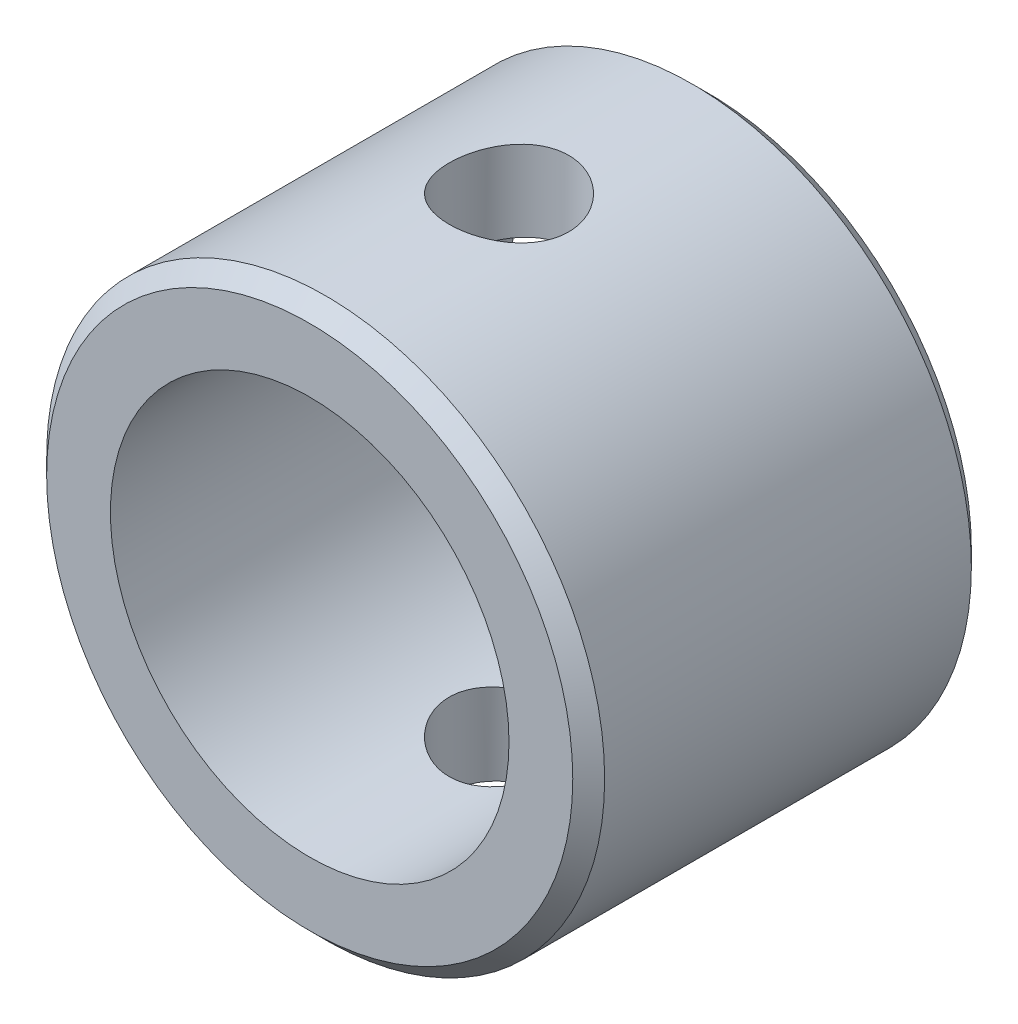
ISO-10303-21;
HEADER;
FILE_DESCRIPTION(('STEP AP214'),'2;1');
FILE_NAME('part.step','',(''),(''),'','','');
FILE_SCHEMA(('AUTOMOTIVE_DESIGN { 1 0 10303 214 1 1 1 1 }'));
ENDSEC;
DATA;
#1=APPLICATION_CONTEXT('core data for automotive mechanical design processes');
#2=APPLICATION_PROTOCOL_DEFINITION('international standard','automotive_design',2000,#1);
#3=PRODUCT_CONTEXT('',#1,'mechanical');
#4=PRODUCT('Part','Part','',(#3));
#5=PRODUCT_RELATED_PRODUCT_CATEGORY('part','',(#4));
#6=PRODUCT_DEFINITION_FORMATION('','',#4);
#7=PRODUCT_DEFINITION_CONTEXT('part definition',#1,'design');
#8=PRODUCT_DEFINITION('design','',#6,#7);
#9=PRODUCT_DEFINITION_SHAPE('','',#8);
#10=(LENGTH_UNIT() NAMED_UNIT(*) SI_UNIT(.MILLI.,.METRE.));
#11=(NAMED_UNIT(*) PLANE_ANGLE_UNIT() SI_UNIT($,.RADIAN.));
#12=(NAMED_UNIT(*) SI_UNIT($,.STERADIAN.) SOLID_ANGLE_UNIT());
#13=UNCERTAINTY_MEASURE_WITH_UNIT(LENGTH_MEASURE(1.E-05),#10,'distance_accuracy_value','');
#14=(GEOMETRIC_REPRESENTATION_CONTEXT(3) GLOBAL_UNCERTAINTY_ASSIGNED_CONTEXT((#13)) GLOBAL_UNIT_ASSIGNED_CONTEXT((#10,
#11,#12)) REPRESENTATION_CONTEXT('',''));
#15=CARTESIAN_POINT('',(0.,0.,0.));
#16=DIRECTION('',(0.,0.,1.));
#17=DIRECTION('',(1.,0.,0.));
#18=AXIS2_PLACEMENT_3D('',#15,#16,#17);
#19=CARTESIAN_POINT('',(0.,0.,2.5));
#20=DIRECTION('',(0.,0.,1.));
#21=DIRECTION('',(1.,0.,0.));
#22=AXIS2_PLACEMENT_3D('',#19,#20,#21);
#23=PLANE('',#22);
#24=CARTESIAN_POINT('',(0.,0.,2.5));
#25=DIRECTION('',(0.,0.,1.));
#26=DIRECTION('',(1.,0.,0.));
#27=AXIS2_PLACEMENT_3D('',#24,#25,#26);
#28=CIRCLE('',#27,3.3);
#29=CARTESIAN_POINT('',(3.3,0.,2.5));
#30=VERTEX_POINT('',#29);
#31=EDGE_CURVE('E10',#30,#30,#28,.T.);
#32=ORIENTED_EDGE('',*,*,#31,.T.);
#33=EDGE_LOOP('',(#32));
#34=FACE_BOUND('',#33,.T.);
#35=CARTESIAN_POINT('',(0.,0.,2.5));
#36=DIRECTION('',(0.,0.,1.));
#37=DIRECTION('',(1.,0.,0.));
#38=AXIS2_PLACEMENT_3D('',#35,#36,#37);
#39=CIRCLE('',#38,2.5);
#40=CARTESIAN_POINT('',(2.5,0.,2.5));
#41=VERTEX_POINT('',#40);
#42=EDGE_CURVE('E89',#41,#41,#39,.T.);
#43=ORIENTED_EDGE('',*,*,#42,.F.);
#44=EDGE_LOOP('',(#43));
#45=FACE_BOUND('',#44,.T.);
#46=ADVANCED_FACE('F32',(#34,#45),#23,.T.);
#47=CARTESIAN_POINT('',(0.,0.,-2.5));
#48=DIRECTION('',(0.,0.,1.));
#49=DIRECTION('',(1.,0.,0.));
#50=AXIS2_PLACEMENT_3D('',#47,#48,#49);
#51=PLANE('',#50);
#52=CARTESIAN_POINT('',(0.,0.,-2.5));
#53=DIRECTION('',(0.,0.,1.));
#54=DIRECTION('',(1.,0.,0.));
#55=AXIS2_PLACEMENT_3D('',#52,#53,#54);
#56=CIRCLE('',#55,3.3);
#57=CARTESIAN_POINT('',(3.3,0.,-2.5));
#58=VERTEX_POINT('',#57);
#59=EDGE_CURVE('E46',#58,#58,#56,.F.);
#60=ORIENTED_EDGE('',*,*,#59,.T.);
#61=EDGE_LOOP('',(#60));
#62=FACE_BOUND('',#61,.T.);
#63=CARTESIAN_POINT('',(0.,0.,-2.5));
#64=DIRECTION('',(0.,0.,1.));
#65=DIRECTION('',(1.,0.,0.));
#66=AXIS2_PLACEMENT_3D('',#63,#64,#65);
#67=CIRCLE('',#66,2.5);
#68=CARTESIAN_POINT('',(2.5,0.,-2.5));
#69=VERTEX_POINT('',#68);
#70=EDGE_CURVE('E86',#69,#69,#67,.T.);
#71=ORIENTED_EDGE('',*,*,#70,.T.);
#72=EDGE_LOOP('',(#71));
#73=FACE_BOUND('',#72,.T.);
#74=ADVANCED_FACE('F110',(#62,#73),#51,.F.);
#75=CARTESIAN_POINT('',(0.,0.,2.5));
#76=DIRECTION('',(0.,0.,-1.));
#77=DIRECTION('',(-1.,0.,0.));
#78=AXIS2_PLACEMENT_3D('',#75,#76,#77);
#79=CYLINDRICAL_SURFACE('',#78,3.5);
#80=CARTESIAN_POINT('',(0.,-3.5,0.75));
#81=CARTESIAN_POINT('',(0.0416179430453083,-3.49999923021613,0.749998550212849));
#82=CARTESIAN_POINT('',(0.0832535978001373,-3.49925012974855,0.746524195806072));
#83=CARTESIAN_POINT('',(0.165343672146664,-3.49633414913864,0.732732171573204));
#84=CARTESIAN_POINT('',(0.205797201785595,-3.4941662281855,0.722409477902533));
#85=CARTESIAN_POINT('',(0.284324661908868,-3.48865415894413,0.695257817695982));
#86=CARTESIAN_POINT('',(0.322400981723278,-3.48531121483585,0.678435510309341));
#87=CARTESIAN_POINT('',(0.395189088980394,-3.47781053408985,0.638782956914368));
#88=CARTESIAN_POINT('',(0.429900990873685,-3.4736528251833,0.615952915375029));
#89=CARTESIAN_POINT('',(0.495512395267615,-3.46490684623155,0.564559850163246));
#90=CARTESIAN_POINT('',(0.526352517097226,-3.4603134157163,0.535921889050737));
#91=CARTESIAN_POINT('',(0.582830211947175,-3.45125034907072,0.473886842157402));
#92=CARTESIAN_POINT('',(0.608467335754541,-3.44678072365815,0.440489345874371));
#93=CARTESIAN_POINT('',(0.654071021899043,-3.43842058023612,0.369447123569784));
#94=CARTESIAN_POINT('',(0.673974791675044,-3.4345366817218,0.331761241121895));
#95=CARTESIAN_POINT('',(0.707144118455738,-3.42786162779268,0.253482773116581));
#96=CARTESIAN_POINT('',(0.720410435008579,-3.42507034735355,0.212890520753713));
#97=CARTESIAN_POINT('',(0.739732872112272,-3.42094904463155,0.130594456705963));
#98=CARTESIAN_POINT('',(0.745893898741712,-3.41959778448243,0.0889163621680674));
#99=CARTESIAN_POINT('',(0.751156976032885,-3.41844569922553,0.00509788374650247));
#100=CARTESIAN_POINT('',(0.750259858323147,-3.41864469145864,-0.0370424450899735));
#101=CARTESIAN_POINT('',(0.741516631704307,-3.42055138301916,-0.119812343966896));
#102=CARTESIAN_POINT('',(0.733791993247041,-3.42223270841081,-0.160455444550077));
#103=CARTESIAN_POINT('',(0.711805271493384,-3.42687296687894,-0.239855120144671));
#104=CARTESIAN_POINT('',(0.697542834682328,-3.42983196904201,-0.27861159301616));
#105=CARTESIAN_POINT('',(0.662772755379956,-3.43672040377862,-0.353481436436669));
#106=CARTESIAN_POINT('',(0.642218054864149,-3.44065710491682,-0.389572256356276));
#107=CARTESIAN_POINT('',(0.595480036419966,-3.44905286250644,-0.457837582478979));
#108=CARTESIAN_POINT('',(0.56929598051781,-3.45351198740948,-0.490011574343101));
#109=CARTESIAN_POINT('',(0.511397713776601,-3.46256359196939,-0.550229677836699));
#110=CARTESIAN_POINT('',(0.479580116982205,-3.46715691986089,-0.578174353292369));
#111=CARTESIAN_POINT('',(0.411658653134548,-3.4758750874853,-0.62834686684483));
#112=CARTESIAN_POINT('',(0.3755547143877,-3.47999991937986,-0.650574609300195));
#113=CARTESIAN_POINT('',(0.29996673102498,-3.48732889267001,-0.688705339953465));
#114=CARTESIAN_POINT('',(0.260476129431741,-3.49053119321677,-0.704595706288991));
#115=CARTESIAN_POINT('',(0.179301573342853,-3.49564054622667,-0.729487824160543));
#116=CARTESIAN_POINT('',(0.137617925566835,-3.49754777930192,-0.738490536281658));
#117=CARTESIAN_POINT('',(0.0540938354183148,-3.49982653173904,-0.749208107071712));
#118=CARTESIAN_POINT('',(0.0122715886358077,-3.50022668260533,-0.75105885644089));
#119=CARTESIAN_POINT('',(-0.071084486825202,-3.49952624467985,-0.747787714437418));
#120=CARTESIAN_POINT('',(-0.112618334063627,-3.49842575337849,-0.74266627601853));
#121=CARTESIAN_POINT('',(-0.193771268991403,-3.49486571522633,-0.725708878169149));
#122=CARTESIAN_POINT('',(-0.233405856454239,-3.4924205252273,-0.713943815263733));
#123=CARTESIAN_POINT('',(-0.310139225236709,-3.48644462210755,-0.68411152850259));
#124=CARTESIAN_POINT('',(-0.34723779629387,-3.48291381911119,-0.666043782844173));
#125=CARTESIAN_POINT('',(-0.418410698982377,-3.475087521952,-0.623833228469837));
#126=CARTESIAN_POINT('',(-0.45243628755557,-3.47078215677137,-0.599610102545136));
#127=CARTESIAN_POINT('',(-0.515988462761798,-3.46190516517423,-0.545882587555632));
#128=CARTESIAN_POINT('',(-0.545514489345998,-3.45733350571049,-0.516377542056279));
#129=CARTESIAN_POINT('',(-0.599763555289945,-3.44834086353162,-0.452301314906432));
#130=CARTESIAN_POINT('',(-0.624392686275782,-3.44392396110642,-0.417649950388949));
#131=CARTESIAN_POINT('',(-0.667482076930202,-3.4358332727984,-0.344622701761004));
#132=CARTESIAN_POINT('',(-0.685942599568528,-3.43215945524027,-0.306246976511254));
#133=CARTESIAN_POINT('',(-0.716048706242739,-3.42600504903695,-0.227063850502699));
#134=CARTESIAN_POINT('',(-0.727731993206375,-3.42351787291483,-0.186271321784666));
#135=CARTESIAN_POINT('',(-0.744063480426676,-3.42000593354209,-0.103242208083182));
#136=CARTESIAN_POINT('',(-0.748712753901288,-3.41898094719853,-0.0610058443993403));
#137=CARTESIAN_POINT('',(-0.750799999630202,-3.41852309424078,0.0227661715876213));
#138=CARTESIAN_POINT('',(-0.748386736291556,-3.41905738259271,0.0642980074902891));
#139=CARTESIAN_POINT('',(-0.736748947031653,-3.42158381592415,0.146348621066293));
#140=CARTESIAN_POINT('',(-0.727524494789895,-3.42357594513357,0.186867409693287));
#141=CARTESIAN_POINT('',(-0.702596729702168,-3.42877790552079,0.265629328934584));
#142=CARTESIAN_POINT('',(-0.686914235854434,-3.43198382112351,0.303879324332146));
#143=CARTESIAN_POINT('',(-0.649533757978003,-3.43925382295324,0.377227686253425));
#144=CARTESIAN_POINT('',(-0.627835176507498,-3.44331799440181,0.412325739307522));
#145=CARTESIAN_POINT('',(-0.578541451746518,-3.45194527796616,0.479109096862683));
#146=CARTESIAN_POINT('',(-0.550839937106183,-3.45651654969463,0.510714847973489));
#147=CARTESIAN_POINT('',(-0.49054327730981,-3.46558724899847,0.56887813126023));
#148=CARTESIAN_POINT('',(-0.457947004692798,-3.47008665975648,0.595434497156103));
#149=CARTESIAN_POINT('',(-0.388301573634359,-3.47857245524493,0.643057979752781));
#150=CARTESIAN_POINT('',(-0.351202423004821,-3.48255182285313,0.664053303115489));
#151=CARTESIAN_POINT('',(-0.273925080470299,-3.48947913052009,0.699477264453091));
#152=CARTESIAN_POINT('',(-0.23374955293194,-3.49242795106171,0.713911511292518));
#153=CARTESIAN_POINT('',(-0.161267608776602,-3.49642424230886,0.733176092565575));
#154=CARTESIAN_POINT('',(-0.129358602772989,-3.49775695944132,0.739473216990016));
#155=CARTESIAN_POINT('',(-0.0649699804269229,-3.4995451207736,0.747885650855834));
#156=CARTESIAN_POINT('',(-0.0324903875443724,-3.50000060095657,0.75000113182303));
#157=CARTESIAN_POINT('',(0.,-3.5,0.75));
#158=B_SPLINE_CURVE_WITH_KNOTS('',3,(#80,#81,#82,#83,#84,#85,#86,#87,#88,#89,#90,#91,#92,#93,
#94,#95,#96,#97,#98,#99,#100,#101,#102,#103,#104,#105,#106,#107,#108,#109,#110,#111,#112,#113,
#114,#115,#116,#117,#118,#119,#120,#121,#122,#123,#124,#125,#126,#127,#128,#129,#130,#131,#132,
#133,#134,#135,#136,#137,#138,#139,#140,#141,#142,#143,#144,#145,#146,#147,#148,#149,#150,#151,
#152,#153,#154,#155,#156,#157),.UNSPECIFIED.,.T.,.F.,(4,2,2,2,2,2,2,2,2,2,2,2,2,2,2,2,2,2,2,2,2,
2,2,2,2,2,2,2,2,2,2,2,2,2,2,2,2,2,4),(0.,0.124734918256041,0.249561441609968,0.374260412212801,
0.498955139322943,0.62537480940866,0.751805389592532,0.879572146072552,1.00732427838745,
1.13316504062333,1.25899097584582,1.38262237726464,1.50626046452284,1.63084678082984,
1.75544943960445,1.88263505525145,2.00982279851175,2.13726260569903,2.26468463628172,
2.38967332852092,2.51465390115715,2.63832530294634,2.76200694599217,2.88739366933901,
3.01279598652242,3.14041031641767,3.26801920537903,3.39491120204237,3.52178383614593,
3.64600340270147,3.77022162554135,3.89404249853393,4.01787567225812,4.14411475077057,
4.27038295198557,4.39820955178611,4.52592667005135,4.62330899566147,4.72068732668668),.UNSPECIFIED.);
#159=CARTESIAN_POINT('',(0.,-3.5,0.75));
#160=VERTEX_POINT('',#159);
#161=EDGE_CURVE('E80',#160,#160,#158,.T.);
#162=ORIENTED_EDGE('',*,*,#161,.T.);
#163=EDGE_LOOP('',(#162));
#164=FACE_BOUND('',#163,.T.);
#165=CARTESIAN_POINT('',(0.,3.5,0.75));
#166=CARTESIAN_POINT('',(-0.0416179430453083,3.49999923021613,0.749998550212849));
#167=CARTESIAN_POINT('',(-0.0832535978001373,3.49925012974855,0.746524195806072));
#168=CARTESIAN_POINT('',(-0.165343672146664,3.49633414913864,0.732732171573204));
#169=CARTESIAN_POINT('',(-0.205797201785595,3.4941662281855,0.722409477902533));
#170=CARTESIAN_POINT('',(-0.284324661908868,3.48865415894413,0.695257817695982));
#171=CARTESIAN_POINT('',(-0.322400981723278,3.48531121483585,0.678435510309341));
#172=CARTESIAN_POINT('',(-0.395189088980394,3.47781053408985,0.638782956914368));
#173=CARTESIAN_POINT('',(-0.429900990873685,3.4736528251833,0.615952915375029));
#174=CARTESIAN_POINT('',(-0.495512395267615,3.46490684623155,0.564559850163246));
#175=CARTESIAN_POINT('',(-0.526352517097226,3.4603134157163,0.535921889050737));
#176=CARTESIAN_POINT('',(-0.582830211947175,3.45125034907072,0.473886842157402));
#177=CARTESIAN_POINT('',(-0.608467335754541,3.44678072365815,0.440489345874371));
#178=CARTESIAN_POINT('',(-0.654071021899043,3.43842058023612,0.369447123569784));
#179=CARTESIAN_POINT('',(-0.673974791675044,3.4345366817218,0.331761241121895));
#180=CARTESIAN_POINT('',(-0.707144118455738,3.42786162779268,0.253482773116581));
#181=CARTESIAN_POINT('',(-0.720410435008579,3.42507034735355,0.212890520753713));
#182=CARTESIAN_POINT('',(-0.739732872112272,3.42094904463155,0.130594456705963));
#183=CARTESIAN_POINT('',(-0.745893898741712,3.41959778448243,0.0889163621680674));
#184=CARTESIAN_POINT('',(-0.751156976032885,3.41844569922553,0.00509788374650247));
#185=CARTESIAN_POINT('',(-0.750259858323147,3.41864469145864,-0.0370424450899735));
#186=CARTESIAN_POINT('',(-0.741516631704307,3.42055138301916,-0.119812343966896));
#187=CARTESIAN_POINT('',(-0.733791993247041,3.42223270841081,-0.160455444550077));
#188=CARTESIAN_POINT('',(-0.711805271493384,3.42687296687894,-0.239855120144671));
#189=CARTESIAN_POINT('',(-0.697542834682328,3.42983196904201,-0.27861159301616));
#190=CARTESIAN_POINT('',(-0.662772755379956,3.43672040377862,-0.353481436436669));
#191=CARTESIAN_POINT('',(-0.642218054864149,3.44065710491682,-0.389572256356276));
#192=CARTESIAN_POINT('',(-0.595480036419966,3.44905286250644,-0.457837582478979));
#193=CARTESIAN_POINT('',(-0.56929598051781,3.45351198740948,-0.490011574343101));
#194=CARTESIAN_POINT('',(-0.511397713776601,3.46256359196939,-0.550229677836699));
#195=CARTESIAN_POINT('',(-0.479580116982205,3.46715691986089,-0.578174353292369));
#196=CARTESIAN_POINT('',(-0.411658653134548,3.4758750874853,-0.62834686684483));
#197=CARTESIAN_POINT('',(-0.3755547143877,3.47999991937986,-0.650574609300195));
#198=CARTESIAN_POINT('',(-0.29996673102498,3.48732889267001,-0.688705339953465));
#199=CARTESIAN_POINT('',(-0.260476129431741,3.49053119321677,-0.704595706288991));
#200=CARTESIAN_POINT('',(-0.179301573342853,3.49564054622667,-0.729487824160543));
#201=CARTESIAN_POINT('',(-0.137617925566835,3.49754777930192,-0.738490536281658));
#202=CARTESIAN_POINT('',(-0.0540938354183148,3.49982653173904,-0.749208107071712));
#203=CARTESIAN_POINT('',(-0.0122715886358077,3.50022668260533,-0.75105885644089));
#204=CARTESIAN_POINT('',(0.071084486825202,3.49952624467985,-0.747787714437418));
#205=CARTESIAN_POINT('',(0.112618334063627,3.49842575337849,-0.74266627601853));
#206=CARTESIAN_POINT('',(0.193771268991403,3.49486571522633,-0.725708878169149));
#207=CARTESIAN_POINT('',(0.233405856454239,3.4924205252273,-0.713943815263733));
#208=CARTESIAN_POINT('',(0.310139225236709,3.48644462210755,-0.68411152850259));
#209=CARTESIAN_POINT('',(0.34723779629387,3.48291381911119,-0.666043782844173));
#210=CARTESIAN_POINT('',(0.418410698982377,3.475087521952,-0.623833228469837));
#211=CARTESIAN_POINT('',(0.45243628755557,3.47078215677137,-0.599610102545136));
#212=CARTESIAN_POINT('',(0.515988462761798,3.46190516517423,-0.545882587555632));
#213=CARTESIAN_POINT('',(0.545514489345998,3.45733350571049,-0.516377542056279));
#214=CARTESIAN_POINT('',(0.599763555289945,3.44834086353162,-0.452301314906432));
#215=CARTESIAN_POINT('',(0.624392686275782,3.44392396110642,-0.417649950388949));
#216=CARTESIAN_POINT('',(0.667482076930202,3.4358332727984,-0.344622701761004));
#217=CARTESIAN_POINT('',(0.685942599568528,3.43215945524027,-0.306246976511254));
#218=CARTESIAN_POINT('',(0.716048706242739,3.42600504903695,-0.227063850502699));
#219=CARTESIAN_POINT('',(0.727731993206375,3.42351787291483,-0.186271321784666));
#220=CARTESIAN_POINT('',(0.744063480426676,3.42000593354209,-0.103242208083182));
#221=CARTESIAN_POINT('',(0.748712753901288,3.41898094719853,-0.0610058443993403));
#222=CARTESIAN_POINT('',(0.750799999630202,3.41852309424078,0.0227661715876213));
#223=CARTESIAN_POINT('',(0.748386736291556,3.41905738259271,0.0642980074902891));
#224=CARTESIAN_POINT('',(0.736748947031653,3.42158381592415,0.146348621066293));
#225=CARTESIAN_POINT('',(0.727524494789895,3.42357594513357,0.186867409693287));
#226=CARTESIAN_POINT('',(0.702596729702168,3.42877790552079,0.265629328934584));
#227=CARTESIAN_POINT('',(0.686914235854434,3.43198382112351,0.303879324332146));
#228=CARTESIAN_POINT('',(0.649533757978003,3.43925382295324,0.377227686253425));
#229=CARTESIAN_POINT('',(0.627835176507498,3.44331799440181,0.412325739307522));
#230=CARTESIAN_POINT('',(0.578541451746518,3.45194527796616,0.479109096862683));
#231=CARTESIAN_POINT('',(0.550839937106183,3.45651654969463,0.510714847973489));
#232=CARTESIAN_POINT('',(0.49054327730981,3.46558724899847,0.56887813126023));
#233=CARTESIAN_POINT('',(0.457947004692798,3.47008665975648,0.595434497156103));
#234=CARTESIAN_POINT('',(0.388301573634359,3.47857245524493,0.643057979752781));
#235=CARTESIAN_POINT('',(0.351202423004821,3.48255182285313,0.664053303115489));
#236=CARTESIAN_POINT('',(0.273925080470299,3.48947913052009,0.699477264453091));
#237=CARTESIAN_POINT('',(0.23374955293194,3.49242795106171,0.713911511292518));
#238=CARTESIAN_POINT('',(0.161267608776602,3.49642424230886,0.733176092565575));
#239=CARTESIAN_POINT('',(0.129358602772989,3.49775695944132,0.739473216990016));
#240=CARTESIAN_POINT('',(0.0649699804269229,3.4995451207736,0.747885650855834));
#241=CARTESIAN_POINT('',(0.0324903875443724,3.50000060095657,0.75000113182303));
#242=CARTESIAN_POINT('',(0.,3.5,0.75));
#243=B_SPLINE_CURVE_WITH_KNOTS('',3,(#165,#166,#167,#168,#169,#170,#171,#172,#173,#174,#175,
#176,#177,#178,#179,#180,#181,#182,#183,#184,#185,#186,#187,#188,#189,#190,#191,#192,#193,#194,
#195,#196,#197,#198,#199,#200,#201,#202,#203,#204,#205,#206,#207,#208,#209,#210,#211,#212,#213,
#214,#215,#216,#217,#218,#219,#220,#221,#222,#223,#224,#225,#226,#227,#228,#229,#230,#231,#232,
#233,#234,#235,#236,#237,#238,#239,#240,#241,#242),.UNSPECIFIED.,.T.,.F.,(4,2,2,2,2,2,2,2,2,2,2,
2,2,2,2,2,2,2,2,2,2,2,2,2,2,2,2,2,2,2,2,2,2,2,2,2,2,2,4),(0.,0.124734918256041,
0.249561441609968,0.374260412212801,0.498955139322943,0.62537480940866,0.751805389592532,
0.879572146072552,1.00732427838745,1.13316504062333,1.25899097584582,1.38262237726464,
1.50626046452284,1.63084678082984,1.75544943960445,1.88263505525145,2.00982279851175,
2.13726260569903,2.26468463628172,2.38967332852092,2.51465390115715,2.63832530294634,
2.76200694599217,2.88739366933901,3.01279598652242,3.14041031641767,3.26801920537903,
3.39491120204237,3.52178383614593,3.64600340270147,3.77022162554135,3.89404249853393,
4.01787567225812,4.14411475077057,4.27038295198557,4.39820955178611,4.52592667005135,
4.62330899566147,4.72068732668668),.UNSPECIFIED.);
#244=CARTESIAN_POINT('',(0.,3.5,0.75));
#245=VERTEX_POINT('',#244);
#246=EDGE_CURVE('E75',#245,#245,#243,.T.);
#247=ORIENTED_EDGE('',*,*,#246,.T.);
#248=EDGE_LOOP('',(#247));
#249=FACE_BOUND('',#248,.T.);
#250=CARTESIAN_POINT('',(0.,0.,-2.3));
#251=DIRECTION('',(0.,0.,1.));
#252=DIRECTION('',(1.,0.,0.));
#253=AXIS2_PLACEMENT_3D('',#250,#251,#252);
#254=CIRCLE('',#253,3.5);
#255=CARTESIAN_POINT('',(3.5,0.,-2.3));
#256=VERTEX_POINT('',#255);
#257=EDGE_CURVE('E51',#256,#256,#254,.T.);
#258=ORIENTED_EDGE('',*,*,#257,.T.);
#259=EDGE_LOOP('',(#258));
#260=FACE_BOUND('',#259,.T.);
#261=CARTESIAN_POINT('',(0.,0.,2.3));
#262=DIRECTION('',(0.,0.,1.));
#263=DIRECTION('',(1.,0.,0.));
#264=AXIS2_PLACEMENT_3D('',#261,#262,#263);
#265=CIRCLE('',#264,3.5);
#266=CARTESIAN_POINT('',(3.5,0.,2.3));
#267=VERTEX_POINT('',#266);
#268=EDGE_CURVE('E92',#267,#267,#265,.F.);
#269=ORIENTED_EDGE('',*,*,#268,.T.);
#270=EDGE_LOOP('',(#269));
#271=FACE_BOUND('',#270,.T.);
#272=ADVANCED_FACE('F34',(#164,#249,#260,#271),#79,.T.);
#273=CARTESIAN_POINT('',(0.,0.,2.5));
#274=DIRECTION('',(0.,0.,-1.));
#275=DIRECTION('',(-1.,0.,0.));
#276=AXIS2_PLACEMENT_3D('',#273,#274,#275);
#277=CYLINDRICAL_SURFACE('',#276,2.5);
#278=CARTESIAN_POINT('',(0.,-2.5,0.75));
#279=CARTESIAN_POINT('',(0.04114430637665,-2.49999964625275,0.749999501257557));
#280=CARTESIAN_POINT('',(0.0822936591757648,-2.49897457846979,0.746603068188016));
#281=CARTESIAN_POINT('',(0.16339406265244,-2.49498552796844,0.73313932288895));
#282=CARTESIAN_POINT('',(0.20334475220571,-2.49202096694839,0.723070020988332));
#283=CARTESIAN_POINT('',(0.280866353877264,-2.48447776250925,0.696626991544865));
#284=CARTESIAN_POINT('',(0.318440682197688,-2.47990150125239,0.680262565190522));
#285=CARTESIAN_POINT('',(0.390312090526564,-2.46961054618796,0.641731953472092));
#286=CARTESIAN_POINT('',(0.42460873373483,-2.46389570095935,0.619564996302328));
#287=CARTESIAN_POINT('',(0.489935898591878,-2.45175368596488,0.569387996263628));
#288=CARTESIAN_POINT('',(0.52085903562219,-2.445311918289,0.541241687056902));
#289=CARTESIAN_POINT('',(0.577624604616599,-2.43252917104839,0.480195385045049));
#290=CARTESIAN_POINT('',(0.603466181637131,-2.42618820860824,0.447294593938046));
#291=CARTESIAN_POINT('',(0.649900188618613,-2.41417056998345,0.376764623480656));
#292=CARTESIAN_POINT('',(0.67036154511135,-2.4085120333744,0.339045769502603));
#293=CARTESIAN_POINT('',(0.704606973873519,-2.39871810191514,0.260505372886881));
#294=CARTESIAN_POINT('',(0.71839264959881,-2.39458234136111,0.219684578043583));
#295=CARTESIAN_POINT('',(0.738508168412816,-2.38845435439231,0.13730486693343));
#296=CARTESIAN_POINT('',(0.745035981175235,-2.38640534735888,0.0957986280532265));
#297=CARTESIAN_POINT('',(0.751068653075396,-2.38451394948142,0.0122334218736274));
#298=CARTESIAN_POINT('',(0.750575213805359,-2.38467102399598,-0.0298254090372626));
#299=CARTESIAN_POINT('',(0.742734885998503,-2.38712372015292,-0.111691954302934));
#300=CARTESIAN_POINT('',(0.735636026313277,-2.38934194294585,-0.151526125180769));
#301=CARTESIAN_POINT('',(0.715187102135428,-2.39554178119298,-0.229409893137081));
#302=CARTESIAN_POINT('',(0.701836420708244,-2.3995235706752,-0.267459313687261));
#303=CARTESIAN_POINT('',(0.669080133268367,-2.40886366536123,-0.341300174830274));
#304=CARTESIAN_POINT('',(0.649594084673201,-2.4142400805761,-0.377053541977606));
#305=CARTESIAN_POINT('',(0.605176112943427,-2.42575493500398,-0.444866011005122));
#306=CARTESIAN_POINT('',(0.580242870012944,-2.43189355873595,-0.476924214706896));
#307=CARTESIAN_POINT('',(0.524406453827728,-2.44455505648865,-0.537843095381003));
#308=CARTESIAN_POINT('',(0.493297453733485,-2.45108327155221,-0.566514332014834));
#309=CARTESIAN_POINT('',(0.426631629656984,-2.46356122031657,-0.618276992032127));
#310=CARTESIAN_POINT('',(0.391074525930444,-2.46951091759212,-0.641368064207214));
#311=CARTESIAN_POINT('',(0.316177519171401,-2.48021580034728,-0.681429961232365));
#312=CARTESIAN_POINT('',(0.276813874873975,-2.48496271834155,-0.698358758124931));
#313=CARTESIAN_POINT('',(0.195622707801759,-2.49266760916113,-0.725299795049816));
#314=CARTESIAN_POINT('',(0.153795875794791,-2.495626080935,-0.735313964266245));
#315=CARTESIAN_POINT('',(0.0704761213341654,-2.49934182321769,-0.747826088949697));
#316=CARTESIAN_POINT('',(0.0290250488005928,-2.50017425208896,-0.750580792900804));
#317=CARTESIAN_POINT('',(-0.0537498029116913,-2.49976461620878,-0.749215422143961));
#318=CARTESIAN_POINT('',(-0.0950735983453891,-2.49852282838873,-0.745096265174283));
#319=CARTESIAN_POINT('',(-0.17545180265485,-2.49415348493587,-0.730307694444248));
#320=CARTESIAN_POINT('',(-0.21453638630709,-2.49106914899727,-0.719788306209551));
#321=CARTESIAN_POINT('',(-0.290377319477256,-2.48337173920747,-0.692678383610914));
#322=CARTESIAN_POINT('',(-0.327133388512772,-2.47875848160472,-0.676087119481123));
#323=CARTESIAN_POINT('',(-0.398218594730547,-2.46834827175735,-0.636873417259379));
#324=CARTESIAN_POINT('',(-0.432471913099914,-2.4625264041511,-0.614120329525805));
#325=CARTESIAN_POINT('',(-0.496761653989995,-2.45036734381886,-0.563387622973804));
#326=CARTESIAN_POINT('',(-0.526797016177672,-2.44403002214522,-0.535406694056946));
#327=CARTESIAN_POINT('',(-0.582928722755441,-2.43126585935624,-0.473806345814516));
#328=CARTESIAN_POINT('',(-0.608842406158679,-2.42484412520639,-0.440019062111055));
#329=CARTESIAN_POINT('',(-0.654644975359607,-2.41288257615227,-0.36843603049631));
#330=CARTESIAN_POINT('',(-0.674534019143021,-2.40734273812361,-0.330640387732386));
#331=CARTESIAN_POINT('',(-0.707586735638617,-2.39783594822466,-0.252233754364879));
#332=CARTESIAN_POINT('',(-0.720781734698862,-2.39386168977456,-0.211636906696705));
#333=CARTESIAN_POINT('',(-0.740108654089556,-2.38795797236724,-0.128656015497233));
#334=CARTESIAN_POINT('',(-0.746242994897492,-2.38602781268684,-0.0862725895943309));
#335=CARTESIAN_POINT('',(-0.751109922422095,-2.38449986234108,-0.00281924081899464));
#336=CARTESIAN_POINT('',(-0.750140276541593,-2.38480823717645,0.0382318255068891));
#337=CARTESIAN_POINT('',(-0.741537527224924,-2.38749700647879,0.119557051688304));
#338=CARTESIAN_POINT('',(-0.733904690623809,-2.3898773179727,0.159831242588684));
#339=CARTESIAN_POINT('',(-0.712384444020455,-2.39637881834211,0.237972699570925));
#340=CARTESIAN_POINT('',(-0.698575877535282,-2.40047802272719,0.275863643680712));
#341=CARTESIAN_POINT('',(-0.665157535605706,-2.40995139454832,0.348821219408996));
#342=CARTESIAN_POINT('',(-0.645546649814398,-2.41532580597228,0.383887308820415));
#343=CARTESIAN_POINT('',(-0.600243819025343,-2.42698838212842,0.451581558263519));
#344=CARTESIAN_POINT('',(-0.574356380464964,-2.43330270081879,0.484074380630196));
#345=CARTESIAN_POINT('',(-0.517587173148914,-2.44600660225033,0.544351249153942));
#346=CARTESIAN_POINT('',(-0.486704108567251,-2.45239620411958,0.572134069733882));
#347=CARTESIAN_POINT('',(-0.419732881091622,-2.46475468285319,0.623011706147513));
#348=CARTESIAN_POINT('',(-0.383518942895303,-2.47070579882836,0.645945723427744));
#349=CARTESIAN_POINT('',(-0.307570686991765,-2.48130340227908,0.685367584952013));
#350=CARTESIAN_POINT('',(-0.267838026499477,-2.48595049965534,0.701858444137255));
#351=CARTESIAN_POINT('',(-0.19037885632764,-2.4930108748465,0.726447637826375));
#352=CARTESIAN_POINT('',(-0.152893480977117,-2.49561013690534,0.735255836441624));
#353=CARTESIAN_POINT('',(-0.0769400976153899,-2.49910472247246,0.747031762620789));
#354=CARTESIAN_POINT('',(-0.0384722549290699,-2.5000003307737,0.75000046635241));
#355=CARTESIAN_POINT('',(0.,-2.5,0.75));
#356=B_SPLINE_CURVE_WITH_KNOTS('',3,(#278,#279,#280,#281,#282,#283,#284,#285,#286,#287,#288,
#289,#290,#291,#292,#293,#294,#295,#296,#297,#298,#299,#300,#301,#302,#303,#304,#305,#306,#307,
#308,#309,#310,#311,#312,#313,#314,#315,#316,#317,#318,#319,#320,#321,#322,#323,#324,#325,#326,
#327,#328,#329,#330,#331,#332,#333,#334,#335,#336,#337,#338,#339,#340,#341,#342,#343,#344,#345,
#346,#347,#348,#349,#350,#351,#352,#353,#354,#355),.UNSPECIFIED.,.T.,.F.,(4,2,2,2,2,2,2,2,2,2,2,
2,2,2,2,2,2,2,2,2,2,2,2,2,2,2,2,2,2,2,2,2,2,2,2,2,2,2,4),(0.,0.123291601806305,0.246619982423,
0.369766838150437,0.492930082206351,0.619278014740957,0.745647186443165,0.874857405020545,
1.00403657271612,1.12959844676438,1.25512989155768,1.37613008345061,1.49714221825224,
1.61981213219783,1.74251180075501,1.87033552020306,1.99816728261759,2.12685523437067,
2.25550726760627,2.37954404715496,2.50356426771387,2.62478373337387,2.74601777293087,
2.87005652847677,2.99412640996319,3.12270200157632,3.25127422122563,3.37923907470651,
3.50716004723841,3.62975077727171,3.75233659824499,3.8734002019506,3.99448698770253,
4.11998462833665,4.2455148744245,4.37471498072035,4.50385455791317,4.61915845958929,
4.73444308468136),.UNSPECIFIED.);
#357=CARTESIAN_POINT('',(0.,-2.5,0.75));
#358=VERTEX_POINT('',#357);
#359=EDGE_CURVE('E37',#358,#358,#356,.T.);
#360=ORIENTED_EDGE('',*,*,#359,.F.);
#361=EDGE_LOOP('',(#360));
#362=FACE_BOUND('',#361,.T.);
#363=CARTESIAN_POINT('',(0.,2.5,0.75));
#364=CARTESIAN_POINT('',(-0.04114430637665,2.49999964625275,0.749999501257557));
#365=CARTESIAN_POINT('',(-0.0822936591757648,2.49897457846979,0.746603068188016));
#366=CARTESIAN_POINT('',(-0.16339406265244,2.49498552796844,0.73313932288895));
#367=CARTESIAN_POINT('',(-0.20334475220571,2.49202096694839,0.723070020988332));
#368=CARTESIAN_POINT('',(-0.280866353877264,2.48447776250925,0.696626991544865));
#369=CARTESIAN_POINT('',(-0.318440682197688,2.47990150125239,0.680262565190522));
#370=CARTESIAN_POINT('',(-0.390312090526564,2.46961054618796,0.641731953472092));
#371=CARTESIAN_POINT('',(-0.42460873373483,2.46389570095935,0.619564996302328));
#372=CARTESIAN_POINT('',(-0.489935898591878,2.45175368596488,0.569387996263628));
#373=CARTESIAN_POINT('',(-0.52085903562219,2.445311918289,0.541241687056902));
#374=CARTESIAN_POINT('',(-0.577624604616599,2.43252917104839,0.480195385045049));
#375=CARTESIAN_POINT('',(-0.603466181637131,2.42618820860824,0.447294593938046));
#376=CARTESIAN_POINT('',(-0.649900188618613,2.41417056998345,0.376764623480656));
#377=CARTESIAN_POINT('',(-0.67036154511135,2.4085120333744,0.339045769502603));
#378=CARTESIAN_POINT('',(-0.704606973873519,2.39871810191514,0.260505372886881));
#379=CARTESIAN_POINT('',(-0.71839264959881,2.39458234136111,0.219684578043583));
#380=CARTESIAN_POINT('',(-0.738508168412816,2.38845435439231,0.13730486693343));
#381=CARTESIAN_POINT('',(-0.745035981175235,2.38640534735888,0.0957986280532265));
#382=CARTESIAN_POINT('',(-0.751068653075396,2.38451394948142,0.0122334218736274));
#383=CARTESIAN_POINT('',(-0.750575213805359,2.38467102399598,-0.0298254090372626));
#384=CARTESIAN_POINT('',(-0.742734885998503,2.38712372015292,-0.111691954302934));
#385=CARTESIAN_POINT('',(-0.735636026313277,2.38934194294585,-0.151526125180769));
#386=CARTESIAN_POINT('',(-0.715187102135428,2.39554178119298,-0.229409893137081));
#387=CARTESIAN_POINT('',(-0.701836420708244,2.3995235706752,-0.267459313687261));
#388=CARTESIAN_POINT('',(-0.669080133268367,2.40886366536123,-0.341300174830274));
#389=CARTESIAN_POINT('',(-0.649594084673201,2.4142400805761,-0.377053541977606));
#390=CARTESIAN_POINT('',(-0.605176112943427,2.42575493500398,-0.444866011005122));
#391=CARTESIAN_POINT('',(-0.580242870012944,2.43189355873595,-0.476924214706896));
#392=CARTESIAN_POINT('',(-0.524406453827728,2.44455505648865,-0.537843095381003));
#393=CARTESIAN_POINT('',(-0.493297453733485,2.45108327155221,-0.566514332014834));
#394=CARTESIAN_POINT('',(-0.426631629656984,2.46356122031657,-0.618276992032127));
#395=CARTESIAN_POINT('',(-0.391074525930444,2.46951091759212,-0.641368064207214));
#396=CARTESIAN_POINT('',(-0.316177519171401,2.48021580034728,-0.681429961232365));
#397=CARTESIAN_POINT('',(-0.276813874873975,2.48496271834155,-0.698358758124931));
#398=CARTESIAN_POINT('',(-0.195622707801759,2.49266760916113,-0.725299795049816));
#399=CARTESIAN_POINT('',(-0.153795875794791,2.495626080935,-0.735313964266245));
#400=CARTESIAN_POINT('',(-0.0704761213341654,2.49934182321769,-0.747826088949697));
#401=CARTESIAN_POINT('',(-0.0290250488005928,2.50017425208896,-0.750580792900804));
#402=CARTESIAN_POINT('',(0.0537498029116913,2.49976461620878,-0.749215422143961));
#403=CARTESIAN_POINT('',(0.0950735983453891,2.49852282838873,-0.745096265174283));
#404=CARTESIAN_POINT('',(0.17545180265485,2.49415348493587,-0.730307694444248));
#405=CARTESIAN_POINT('',(0.21453638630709,2.49106914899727,-0.719788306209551));
#406=CARTESIAN_POINT('',(0.290377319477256,2.48337173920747,-0.692678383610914));
#407=CARTESIAN_POINT('',(0.327133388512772,2.47875848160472,-0.676087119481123));
#408=CARTESIAN_POINT('',(0.398218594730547,2.46834827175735,-0.636873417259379));
#409=CARTESIAN_POINT('',(0.432471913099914,2.4625264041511,-0.614120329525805));
#410=CARTESIAN_POINT('',(0.496761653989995,2.45036734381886,-0.563387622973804));
#411=CARTESIAN_POINT('',(0.526797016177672,2.44403002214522,-0.535406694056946));
#412=CARTESIAN_POINT('',(0.582928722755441,2.43126585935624,-0.473806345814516));
#413=CARTESIAN_POINT('',(0.608842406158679,2.42484412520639,-0.440019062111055));
#414=CARTESIAN_POINT('',(0.654644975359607,2.41288257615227,-0.36843603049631));
#415=CARTESIAN_POINT('',(0.674534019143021,2.40734273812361,-0.330640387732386));
#416=CARTESIAN_POINT('',(0.707586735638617,2.39783594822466,-0.252233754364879));
#417=CARTESIAN_POINT('',(0.720781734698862,2.39386168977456,-0.211636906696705));
#418=CARTESIAN_POINT('',(0.740108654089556,2.38795797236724,-0.128656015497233));
#419=CARTESIAN_POINT('',(0.746242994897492,2.38602781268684,-0.0862725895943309));
#420=CARTESIAN_POINT('',(0.751109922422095,2.38449986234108,-0.00281924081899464));
#421=CARTESIAN_POINT('',(0.750140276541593,2.38480823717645,0.0382318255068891));
#422=CARTESIAN_POINT('',(0.741537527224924,2.38749700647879,0.119557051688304));
#423=CARTESIAN_POINT('',(0.733904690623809,2.3898773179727,0.159831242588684));
#424=CARTESIAN_POINT('',(0.712384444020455,2.39637881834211,0.237972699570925));
#425=CARTESIAN_POINT('',(0.698575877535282,2.40047802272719,0.275863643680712));
#426=CARTESIAN_POINT('',(0.665157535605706,2.40995139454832,0.348821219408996));
#427=CARTESIAN_POINT('',(0.645546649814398,2.41532580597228,0.383887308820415));
#428=CARTESIAN_POINT('',(0.600243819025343,2.42698838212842,0.451581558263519));
#429=CARTESIAN_POINT('',(0.574356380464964,2.43330270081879,0.484074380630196));
#430=CARTESIAN_POINT('',(0.517587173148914,2.44600660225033,0.544351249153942));
#431=CARTESIAN_POINT('',(0.486704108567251,2.45239620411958,0.572134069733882));
#432=CARTESIAN_POINT('',(0.419732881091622,2.46475468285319,0.623011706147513));
#433=CARTESIAN_POINT('',(0.383518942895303,2.47070579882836,0.645945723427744));
#434=CARTESIAN_POINT('',(0.307570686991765,2.48130340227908,0.685367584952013));
#435=CARTESIAN_POINT('',(0.267838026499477,2.48595049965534,0.701858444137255));
#436=CARTESIAN_POINT('',(0.19037885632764,2.4930108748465,0.726447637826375));
#437=CARTESIAN_POINT('',(0.152893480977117,2.49561013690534,0.735255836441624));
#438=CARTESIAN_POINT('',(0.0769400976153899,2.49910472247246,0.747031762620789));
#439=CARTESIAN_POINT('',(0.0384722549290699,2.5000003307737,0.75000046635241));
#440=CARTESIAN_POINT('',(0.,2.5,0.75));
#441=B_SPLINE_CURVE_WITH_KNOTS('',3,(#363,#364,#365,#366,#367,#368,#369,#370,#371,#372,#373,
#374,#375,#376,#377,#378,#379,#380,#381,#382,#383,#384,#385,#386,#387,#388,#389,#390,#391,#392,
#393,#394,#395,#396,#397,#398,#399,#400,#401,#402,#403,#404,#405,#406,#407,#408,#409,#410,#411,
#412,#413,#414,#415,#416,#417,#418,#419,#420,#421,#422,#423,#424,#425,#426,#427,#428,#429,#430,
#431,#432,#433,#434,#435,#436,#437,#438,#439,#440),.UNSPECIFIED.,.T.,.F.,(4,2,2,2,2,2,2,2,2,2,2,
2,2,2,2,2,2,2,2,2,2,2,2,2,2,2,2,2,2,2,2,2,2,2,2,2,2,2,4),(0.,0.123291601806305,0.246619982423,
0.369766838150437,0.492930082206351,0.619278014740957,0.745647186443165,0.874857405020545,
1.00403657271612,1.12959844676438,1.25512989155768,1.37613008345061,1.49714221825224,
1.61981213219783,1.74251180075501,1.87033552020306,1.99816728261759,2.12685523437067,
2.25550726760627,2.37954404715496,2.50356426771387,2.62478373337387,2.74601777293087,
2.87005652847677,2.99412640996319,3.12270200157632,3.25127422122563,3.37923907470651,
3.50716004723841,3.62975077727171,3.75233659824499,3.8734002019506,3.99448698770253,
4.11998462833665,4.2455148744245,4.37471498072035,4.50385455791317,4.61915845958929,
4.73444308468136),.UNSPECIFIED.);
#442=CARTESIAN_POINT('',(0.,2.5,0.75));
#443=VERTEX_POINT('',#442);
#444=EDGE_CURVE('E54',#443,#443,#441,.T.);
#445=ORIENTED_EDGE('',*,*,#444,.F.);
#446=EDGE_LOOP('',(#445));
#447=FACE_BOUND('',#446,.T.);
#448=ORIENTED_EDGE('',*,*,#42,.T.);
#449=EDGE_LOOP('',(#448));
#450=FACE_BOUND('',#449,.T.);
#451=ORIENTED_EDGE('',*,*,#70,.F.);
#452=EDGE_LOOP('',(#451));
#453=FACE_BOUND('',#452,.T.);
#454=ADVANCED_FACE('F59',(#362,#447,#450,#453),#277,.F.);
#455=CARTESIAN_POINT('',(0.,0.,-2.3));
#456=DIRECTION('',(0.,0.,1.));
#457=DIRECTION('',(1.,0.,0.));
#458=AXIS2_PLACEMENT_3D('',#455,#456,#457);
#459=CONICAL_SURFACE('',#458,3.5,0.78539816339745);
#460=CARTESIAN_POINT('',(3.3,0.,-2.5));
#461=CARTESIAN_POINT('',(3.30208333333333,0.,-2.49791666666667));
#462=CARTESIAN_POINT('',(3.30416666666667,0.,-2.49583333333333));
#463=CARTESIAN_POINT('',(3.30833333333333,0.,-2.49166666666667));
#464=CARTESIAN_POINT('',(3.31041666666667,0.,-2.48958333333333));
#465=CARTESIAN_POINT('',(3.31458333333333,0.,-2.48541666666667));
#466=CARTESIAN_POINT('',(3.31666666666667,0.,-2.48333333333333));
#467=CARTESIAN_POINT('',(3.32083333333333,0.,-2.47916666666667));
#468=CARTESIAN_POINT('',(3.32291666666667,0.,-2.47708333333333));
#469=CARTESIAN_POINT('',(3.32708333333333,0.,-2.47291666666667));
#470=CARTESIAN_POINT('',(3.32916666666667,0.,-2.47083333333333));
#471=CARTESIAN_POINT('',(3.33333333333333,0.,-2.46666666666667));
#472=CARTESIAN_POINT('',(3.33541666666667,0.,-2.46458333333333));
#473=CARTESIAN_POINT('',(3.33958333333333,0.,-2.46041666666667));
#474=CARTESIAN_POINT('',(3.34166666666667,0.,-2.45833333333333));
#475=CARTESIAN_POINT('',(3.34583333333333,0.,-2.45416666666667));
#476=CARTESIAN_POINT('',(3.34791666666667,0.,-2.45208333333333));
#477=CARTESIAN_POINT('',(3.35208333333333,0.,-2.44791666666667));
#478=CARTESIAN_POINT('',(3.35416666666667,0.,-2.44583333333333));
#479=CARTESIAN_POINT('',(3.35833333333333,0.,-2.44166666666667));
#480=CARTESIAN_POINT('',(3.36041666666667,0.,-2.43958333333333));
#481=CARTESIAN_POINT('',(3.36458333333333,0.,-2.43541666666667));
#482=CARTESIAN_POINT('',(3.36666666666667,0.,-2.43333333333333));
#483=CARTESIAN_POINT('',(3.37083333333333,0.,-2.42916666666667));
#484=CARTESIAN_POINT('',(3.37291666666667,0.,-2.42708333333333));
#485=CARTESIAN_POINT('',(3.37708333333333,0.,-2.42291666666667));
#486=CARTESIAN_POINT('',(3.37916666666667,0.,-2.42083333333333));
#487=CARTESIAN_POINT('',(3.38333333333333,0.,-2.41666666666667));
#488=CARTESIAN_POINT('',(3.38541666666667,0.,-2.41458333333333));
#489=CARTESIAN_POINT('',(3.38958333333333,0.,-2.41041666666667));
#490=CARTESIAN_POINT('',(3.39166666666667,0.,-2.40833333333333));
#491=CARTESIAN_POINT('',(3.39583333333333,0.,-2.40416666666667));
#492=CARTESIAN_POINT('',(3.39791666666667,0.,-2.40208333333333));
#493=CARTESIAN_POINT('',(3.40208333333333,0.,-2.39791666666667));
#494=CARTESIAN_POINT('',(3.40416666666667,0.,-2.39583333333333));
#495=CARTESIAN_POINT('',(3.40833333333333,0.,-2.39166666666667));
#496=CARTESIAN_POINT('',(3.41041666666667,0.,-2.38958333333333));
#497=CARTESIAN_POINT('',(3.41458333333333,0.,-2.38541666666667));
#498=CARTESIAN_POINT('',(3.41666666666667,0.,-2.38333333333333));
#499=CARTESIAN_POINT('',(3.42083333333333,0.,-2.37916666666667));
#500=CARTESIAN_POINT('',(3.42291666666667,0.,-2.37708333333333));
#501=CARTESIAN_POINT('',(3.42708333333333,0.,-2.37291666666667));
#502=CARTESIAN_POINT('',(3.42916666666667,0.,-2.37083333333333));
#503=CARTESIAN_POINT('',(3.43333333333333,0.,-2.36666666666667));
#504=CARTESIAN_POINT('',(3.43541666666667,0.,-2.36458333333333));
#505=CARTESIAN_POINT('',(3.43958333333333,0.,-2.36041666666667));
#506=CARTESIAN_POINT('',(3.44166666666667,0.,-2.35833333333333));
#507=CARTESIAN_POINT('',(3.44583333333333,0.,-2.35416666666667));
#508=CARTESIAN_POINT('',(3.44791666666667,0.,-2.35208333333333));
#509=CARTESIAN_POINT('',(3.45208333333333,0.,-2.34791666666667));
#510=CARTESIAN_POINT('',(3.45416666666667,0.,-2.34583333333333));
#511=CARTESIAN_POINT('',(3.45833333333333,0.,-2.34166666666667));
#512=CARTESIAN_POINT('',(3.46041666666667,0.,-2.33958333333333));
#513=CARTESIAN_POINT('',(3.46458333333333,0.,-2.33541666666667));
#514=CARTESIAN_POINT('',(3.46666666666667,0.,-2.33333333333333));
#515=CARTESIAN_POINT('',(3.47083333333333,0.,-2.32916666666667));
#516=CARTESIAN_POINT('',(3.47291666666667,0.,-2.32708333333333));
#517=CARTESIAN_POINT('',(3.47708333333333,0.,-2.32291666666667));
#518=CARTESIAN_POINT('',(3.47916666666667,0.,-2.32083333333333));
#519=CARTESIAN_POINT('',(3.48333333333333,0.,-2.31666666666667));
#520=CARTESIAN_POINT('',(3.48541666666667,0.,-2.31458333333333));
#521=CARTESIAN_POINT('',(3.48958333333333,0.,-2.31041666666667));
#522=CARTESIAN_POINT('',(3.49166666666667,0.,-2.30833333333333));
#523=CARTESIAN_POINT('',(3.49583333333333,0.,-2.30416666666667));
#524=CARTESIAN_POINT('',(3.49791666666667,0.,-2.30208333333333));
#525=CARTESIAN_POINT('',(3.5,0.,-2.3));
#526=B_SPLINE_CURVE_WITH_KNOTS('',3,(#460,#461,#462,#463,#464,#465,#466,#467,#468,#469,#470,
#471,#472,#473,#474,#475,#476,#477,#478,#479,#480,#481,#482,#483,#484,#485,#486,#487,#488,#489,
#490,#491,#492,#493,#494,#495,#496,#497,#498,#499,#500,#501,#502,#503,#504,#505,#506,#507,#508,
#509,#510,#511,#512,#513,#514,#515,#516,#517,#518,#519,#520,#521,#522,#523,#524,#525),
.UNSPECIFIED.,.F.,.F.,(4,2,2,2,2,2,2,2,2,2,2,2,2,2,2,2,2,2,2,2,2,2,2,2,2,2,2,2,2,2,2,2,4),(0.,
0.00883883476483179,0.0176776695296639,0.0265165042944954,0.0353553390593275,0.0441941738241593,
0.053033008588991,0.0618718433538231,0.0707106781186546,0.0795495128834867,0.0883883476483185,
0.0972271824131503,0.106066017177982,0.114904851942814,0.123743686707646,0.132582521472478,
0.14142135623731,0.150260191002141,0.159099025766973,0.167937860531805,0.176776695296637,
0.185615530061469,0.194454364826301,0.203293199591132,0.212132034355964,0.220970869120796,
0.229809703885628,0.23864853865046,0.247487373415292,0.256326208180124,0.265165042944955,
0.274003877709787,0.282842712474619),.UNSPECIFIED.);
#527=EDGE_CURVE('BSEAM99',#58,#256,#526,.T.);
#528=ORIENTED_EDGE('',*,*,#59,.F.);
#529=ORIENTED_EDGE('',*,*,#257,.F.);
#530=ORIENTED_EDGE('',*,*,#527,.T.);
#531=ORIENTED_EDGE('',*,*,#527,.F.);
#532=EDGE_LOOP('',(#528,#530,#529,#531));
#533=FACE_BOUND('',#532,.T.);
#534=ADVANCED_FACE('F99',(#533),#459,.T.);
#535=CARTESIAN_POINT('',(0.,0.,2.5));
#536=DIRECTION('',(0.,0.,-1.));
#537=DIRECTION('',(-1.,0.,0.));
#538=AXIS2_PLACEMENT_3D('',#535,#536,#537);
#539=CONICAL_SURFACE('',#538,3.3,0.785398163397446);
#540=ORIENTED_EDGE('',*,*,#268,.F.);
#541=EDGE_LOOP('',(#540));
#542=FACE_BOUND('',#541,.T.);
#543=ORIENTED_EDGE('',*,*,#31,.F.);
#544=EDGE_LOOP('',(#543));
#545=FACE_BOUND('',#544,.T.);
#546=ADVANCED_FACE('F69',(#542,#545),#539,.T.);
#547=CARTESIAN_POINT('',(0.,-5.,0.));
#548=DIRECTION('',(0.,1.,0.));
#549=DIRECTION('',(0.,0.,1.));
#550=AXIS2_PLACEMENT_3D('',#547,#548,#549);
#551=CYLINDRICAL_SURFACE('',#550,0.75);
#552=ORIENTED_EDGE('',*,*,#444,.T.);
#553=EDGE_LOOP('',(#552));
#554=FACE_BOUND('',#553,.T.);
#555=ORIENTED_EDGE('',*,*,#246,.F.);
#556=EDGE_LOOP('',(#555));
#557=FACE_BOUND('',#556,.T.);
#558=ADVANCED_FACE('F67',(#554,#557),#551,.F.);
#559=ORIENTED_EDGE('',*,*,#359,.T.);
#560=EDGE_LOOP('',(#559));
#561=FACE_BOUND('',#560,.T.);
#562=ORIENTED_EDGE('',*,*,#161,.F.);
#563=EDGE_LOOP('',(#562));
#564=FACE_BOUND('',#563,.T.);
#565=ADVANCED_FACE('F63',(#561,#564),#551,.F.);
#566=CLOSED_SHELL('',(#46,#74,#272,#454,#534,#546,#558,#565));
#567=MANIFOLD_SOLID_BREP('B2',#566);
#568=ADVANCED_BREP_SHAPE_REPRESENTATION('',(#18,#567),#14);
#569=SHAPE_DEFINITION_REPRESENTATION(#9,#568);
ENDSEC;
END-ISO-10303-21;
